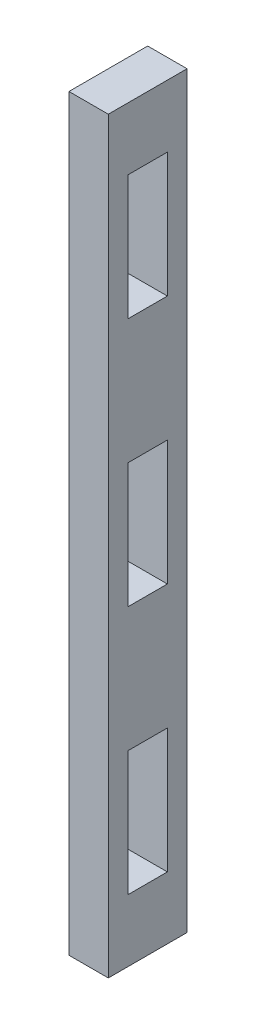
ISO-10303-21;
HEADER;
FILE_DESCRIPTION(('STEP AP214'),'2;1');
FILE_NAME('part.step','',(''),(''),'','','');
FILE_SCHEMA(('AUTOMOTIVE_DESIGN { 1 0 10303 214 1 1 1 1 }'));
ENDSEC;
DATA;
#1=APPLICATION_CONTEXT('core data for automotive mechanical design processes');
#2=APPLICATION_PROTOCOL_DEFINITION('international standard','automotive_design',2000,#1);
#3=PRODUCT_CONTEXT('',#1,'mechanical');
#4=PRODUCT('Part','Part','',(#3));
#5=PRODUCT_RELATED_PRODUCT_CATEGORY('part','',(#4));
#6=PRODUCT_DEFINITION_FORMATION('','',#4);
#7=PRODUCT_DEFINITION_CONTEXT('part definition',#1,'design');
#8=PRODUCT_DEFINITION('design','',#6,#7);
#9=PRODUCT_DEFINITION_SHAPE('','',#8);
#10=(LENGTH_UNIT() NAMED_UNIT(*) SI_UNIT(.MILLI.,.METRE.));
#11=(NAMED_UNIT(*) PLANE_ANGLE_UNIT() SI_UNIT($,.RADIAN.));
#12=(NAMED_UNIT(*) SI_UNIT($,.STERADIAN.) SOLID_ANGLE_UNIT());
#13=UNCERTAINTY_MEASURE_WITH_UNIT(LENGTH_MEASURE(1.E-05),#10,'distance_accuracy_value','');
#14=(GEOMETRIC_REPRESENTATION_CONTEXT(3) GLOBAL_UNCERTAINTY_ASSIGNED_CONTEXT((#13)) GLOBAL_UNIT_ASSIGNED_CONTEXT((#10,
#11,#12)) REPRESENTATION_CONTEXT('',''));
#15=CARTESIAN_POINT('',(0.,0.,0.));
#16=DIRECTION('',(0.,0.,1.));
#17=DIRECTION('',(1.,0.,0.));
#18=AXIS2_PLACEMENT_3D('',#15,#16,#17);
#19=CARTESIAN_POINT('',(0.,55.2979166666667,-1.5875));
#20=DIRECTION('',(0.,1.,0.));
#21=DIRECTION('',(0.,0.,1.));
#22=AXIS2_PLACEMENT_3D('',#19,#20,#21);
#23=PLANE('',#22);
#24=DIRECTION('',(0.,0.,1.));
#25=VECTOR('',#24,1.);
#26=CARTESIAN_POINT('',(3.175,55.2979166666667,-1.5875));
#27=LINE('',#26,#25);
#28=CARTESIAN_POINT('',(3.175,55.2979166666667,-4.7625));
#29=VERTEX_POINT('',#28);
#30=CARTESIAN_POINT('',(3.175,55.2979166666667,-1.5875));
#31=VERTEX_POINT('',#30);
#32=EDGE_CURVE('E263',#29,#31,#27,.T.);
#33=ORIENTED_EDGE('',*,*,#32,.T.);
#34=DIRECTION('',(1.,0.,0.));
#35=VECTOR('',#34,1.);
#36=CARTESIAN_POINT('',(0.,55.2979166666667,-1.5875));
#37=LINE('',#36,#35);
#38=CARTESIAN_POINT('',(0.,55.2979166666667,-1.5875));
#39=VERTEX_POINT('',#38);
#40=EDGE_CURVE('E11',#39,#31,#37,.T.);
#41=ORIENTED_EDGE('',*,*,#40,.F.);
#42=DIRECTION('',(0.,0.,1.));
#43=VECTOR('',#42,1.);
#44=CARTESIAN_POINT('',(0.,55.2979166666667,-1.5875));
#45=LINE('',#44,#43);
#46=CARTESIAN_POINT('',(0.,55.2979166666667,-4.7625));
#47=VERTEX_POINT('',#46);
#48=EDGE_CURVE('E267',#47,#39,#45,.T.);
#49=ORIENTED_EDGE('',*,*,#48,.F.);
#50=DIRECTION('',(1.,0.,0.));
#51=VECTOR('',#50,1.);
#52=CARTESIAN_POINT('',(0.,55.2979166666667,-4.7625));
#53=LINE('',#52,#51);
#54=EDGE_CURVE('E272',#47,#29,#53,.T.);
#55=ORIENTED_EDGE('',*,*,#54,.T.);
#56=EDGE_LOOP('',(#33,#41,#49,#55));
#57=FACE_BOUND('',#56,.T.);
#58=ADVANCED_FACE('F38',(#57),#23,.F.);
#59=CARTESIAN_POINT('',(0.,55.2979166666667,-1.5875));
#60=DIRECTION('',(0.,0.,1.));
#61=DIRECTION('',(0.,-1.,0.));
#62=AXIS2_PLACEMENT_3D('',#59,#60,#61);
#63=PLANE('',#62);
#64=DIRECTION('',(0.,-1.,0.));
#65=VECTOR('',#64,1.);
#66=CARTESIAN_POINT('',(3.175,55.2979166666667,-1.5875));
#67=LINE('',#66,#65);
#68=CARTESIAN_POINT('',(3.175,45.24375,-1.5875));
#69=VERTEX_POINT('',#68);
#70=EDGE_CURVE('E260',#31,#69,#67,.T.);
#71=ORIENTED_EDGE('',*,*,#70,.T.);
#72=DIRECTION('',(1.,0.,0.));
#73=VECTOR('',#72,1.);
#74=CARTESIAN_POINT('',(0.,45.24375,-1.5875));
#75=LINE('',#74,#73);
#76=CARTESIAN_POINT('',(0.,45.24375,-1.5875));
#77=VERTEX_POINT('',#76);
#78=EDGE_CURVE('E45',#77,#69,#75,.T.);
#79=ORIENTED_EDGE('',*,*,#78,.F.);
#80=DIRECTION('',(0.,-1.,0.));
#81=VECTOR('',#80,1.);
#82=CARTESIAN_POINT('',(0.,55.2979166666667,-1.5875));
#83=LINE('',#82,#81);
#84=EDGE_CURVE('E59',#39,#77,#83,.T.);
#85=ORIENTED_EDGE('',*,*,#84,.F.);
#86=ORIENTED_EDGE('',*,*,#40,.T.);
#87=EDGE_LOOP('',(#71,#79,#85,#86));
#88=FACE_BOUND('',#87,.T.);
#89=ADVANCED_FACE('F282',(#88),#63,.F.);
#90=CARTESIAN_POINT('',(0.,45.24375,-1.5875));
#91=DIRECTION('',(0.,-1.,0.));
#92=DIRECTION('',(0.,0.,-1.));
#93=AXIS2_PLACEMENT_3D('',#90,#91,#92);
#94=PLANE('',#93);
#95=DIRECTION('',(0.,0.,-1.));
#96=VECTOR('',#95,1.);
#97=CARTESIAN_POINT('',(3.175,45.24375,-1.5875));
#98=LINE('',#97,#96);
#99=CARTESIAN_POINT('',(3.175,45.24375,-4.7625));
#100=VERTEX_POINT('',#99);
#101=EDGE_CURVE('E257',#69,#100,#98,.T.);
#102=ORIENTED_EDGE('',*,*,#101,.T.);
#103=DIRECTION('',(1.,0.,0.));
#104=VECTOR('',#103,1.);
#105=CARTESIAN_POINT('',(0.,45.24375,-4.7625));
#106=LINE('',#105,#104);
#107=CARTESIAN_POINT('',(0.,45.24375,-4.7625));
#108=VERTEX_POINT('',#107);
#109=EDGE_CURVE('E275',#108,#100,#106,.T.);
#110=ORIENTED_EDGE('',*,*,#109,.F.);
#111=DIRECTION('',(0.,0.,-1.));
#112=VECTOR('',#111,1.);
#113=CARTESIAN_POINT('',(0.,45.24375,-1.5875));
#114=LINE('',#113,#112);
#115=EDGE_CURVE('E270',#77,#108,#114,.T.);
#116=ORIENTED_EDGE('',*,*,#115,.F.);
#117=ORIENTED_EDGE('',*,*,#78,.T.);
#118=EDGE_LOOP('',(#102,#110,#116,#117));
#119=FACE_BOUND('',#118,.T.);
#120=ADVANCED_FACE('F279',(#119),#94,.F.);
#121=CARTESIAN_POINT('',(0.,55.2979166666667,-4.7625));
#122=DIRECTION('',(0.,0.,-1.));
#123=DIRECTION('',(0.,1.,0.));
#124=AXIS2_PLACEMENT_3D('',#121,#122,#123);
#125=PLANE('',#124);
#126=DIRECTION('',(0.,1.,0.));
#127=VECTOR('',#126,1.);
#128=CARTESIAN_POINT('',(3.175,55.2979166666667,-4.7625));
#129=LINE('',#128,#127);
#130=EDGE_CURVE('E255',#100,#29,#129,.T.);
#131=ORIENTED_EDGE('',*,*,#130,.T.);
#132=ORIENTED_EDGE('',*,*,#54,.F.);
#133=DIRECTION('',(0.,1.,0.));
#134=VECTOR('',#133,1.);
#135=CARTESIAN_POINT('',(0.,55.2979166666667,-4.7625));
#136=LINE('',#135,#134);
#137=EDGE_CURVE('E52',#108,#47,#136,.T.);
#138=ORIENTED_EDGE('',*,*,#137,.F.);
#139=ORIENTED_EDGE('',*,*,#109,.T.);
#140=EDGE_LOOP('',(#131,#132,#138,#139));
#141=FACE_BOUND('',#140,.T.);
#142=ADVANCED_FACE('F288',(#141),#125,.F.);
#143=CARTESIAN_POINT('',(3.175,0.,0.));
#144=DIRECTION('',(0.,0.,-1.));
#145=DIRECTION('',(-1.,0.,0.));
#146=AXIS2_PLACEMENT_3D('',#143,#144,#145);
#147=PLANE('',#146);
#148=DIRECTION('',(0.,-1.,0.));
#149=VECTOR('',#148,1.);
#150=CARTESIAN_POINT('',(0.,0.,0.));
#151=LINE('',#150,#149);
#152=CARTESIAN_POINT('',(0.,60.325,0.));
#153=VERTEX_POINT('',#152);
#154=CARTESIAN_POINT('',(0.,0.,0.));
#155=VERTEX_POINT('',#154);
#156=EDGE_CURVE('E219',#153,#155,#151,.T.);
#157=ORIENTED_EDGE('',*,*,#156,.T.);
#158=DIRECTION('',(-1.,0.,0.));
#159=VECTOR('',#158,1.);
#160=CARTESIAN_POINT('',(3.175,0.,0.));
#161=LINE('',#160,#159);
#162=CARTESIAN_POINT('',(3.175,0.,0.));
#163=VERTEX_POINT('',#162);
#164=EDGE_CURVE('E252',#163,#155,#161,.T.);
#165=ORIENTED_EDGE('',*,*,#164,.F.);
#166=DIRECTION('',(0.,-1.,0.));
#167=VECTOR('',#166,1.);
#168=CARTESIAN_POINT('',(3.175,0.,0.));
#169=LINE('',#168,#167);
#170=CARTESIAN_POINT('',(3.175,60.325,0.));
#171=VERTEX_POINT('',#170);
#172=EDGE_CURVE('E226',#171,#163,#169,.T.);
#173=ORIENTED_EDGE('',*,*,#172,.F.);
#174=DIRECTION('',(-1.,0.,0.));
#175=VECTOR('',#174,1.);
#176=CARTESIAN_POINT('',(3.175,60.325,0.));
#177=LINE('',#176,#175);
#178=EDGE_CURVE('E236',#171,#153,#177,.T.);
#179=ORIENTED_EDGE('',*,*,#178,.T.);
#180=EDGE_LOOP('',(#157,#165,#173,#179));
#181=FACE_BOUND('',#180,.T.);
#182=ADVANCED_FACE('F290',(#181),#147,.F.);
#183=CARTESIAN_POINT('',(3.175,0.,0.));
#184=DIRECTION('',(0.,1.,0.));
#185=DIRECTION('',(0.,0.,1.));
#186=AXIS2_PLACEMENT_3D('',#183,#184,#185);
#187=PLANE('',#186);
#188=DIRECTION('',(0.,0.,-1.));
#189=VECTOR('',#188,1.);
#190=CARTESIAN_POINT('',(0.,0.,0.));
#191=LINE('',#190,#189);
#192=CARTESIAN_POINT('',(0.,0.,-6.35));
#193=VERTEX_POINT('',#192);
#194=EDGE_CURVE('E239',#155,#193,#191,.T.);
#195=ORIENTED_EDGE('',*,*,#194,.T.);
#196=DIRECTION('',(-1.,0.,0.));
#197=VECTOR('',#196,1.);
#198=CARTESIAN_POINT('',(3.175,0.,-6.35));
#199=LINE('',#198,#197);
#200=CARTESIAN_POINT('',(3.175,0.,-6.35));
#201=VERTEX_POINT('',#200);
#202=EDGE_CURVE('E249',#201,#193,#199,.T.);
#203=ORIENTED_EDGE('',*,*,#202,.F.);
#204=DIRECTION('',(0.,0.,-1.));
#205=VECTOR('',#204,1.);
#206=CARTESIAN_POINT('',(3.175,0.,0.));
#207=LINE('',#206,#205);
#208=EDGE_CURVE('E229',#163,#201,#207,.T.);
#209=ORIENTED_EDGE('',*,*,#208,.F.);
#210=ORIENTED_EDGE('',*,*,#164,.T.);
#211=EDGE_LOOP('',(#195,#203,#209,#210));
#212=FACE_BOUND('',#211,.T.);
#213=ADVANCED_FACE('F296',(#212),#187,.F.);
#214=CARTESIAN_POINT('',(3.175,0.,-6.35));
#215=DIRECTION('',(0.,0.,1.));
#216=DIRECTION('',(1.,0.,0.));
#217=AXIS2_PLACEMENT_3D('',#214,#215,#216);
#218=PLANE('',#217);
#219=DIRECTION('',(0.,1.,0.));
#220=VECTOR('',#219,1.);
#221=CARTESIAN_POINT('',(0.,0.,-6.35));
#222=LINE('',#221,#220);
#223=CARTESIAN_POINT('',(0.,60.325,-6.35));
#224=VERTEX_POINT('',#223);
#225=EDGE_CURVE('E241',#193,#224,#222,.T.);
#226=ORIENTED_EDGE('',*,*,#225,.T.);
#227=DIRECTION('',(-1.,0.,0.));
#228=VECTOR('',#227,1.);
#229=CARTESIAN_POINT('',(3.175,60.325,-6.35));
#230=LINE('',#229,#228);
#231=CARTESIAN_POINT('',(3.175,60.325,-6.35));
#232=VERTEX_POINT('',#231);
#233=EDGE_CURVE('E246',#232,#224,#230,.T.);
#234=ORIENTED_EDGE('',*,*,#233,.F.);
#235=DIRECTION('',(0.,1.,0.));
#236=VECTOR('',#235,1.);
#237=CARTESIAN_POINT('',(3.175,0.,-6.35));
#238=LINE('',#237,#236);
#239=EDGE_CURVE('E232',#201,#232,#238,.T.);
#240=ORIENTED_EDGE('',*,*,#239,.F.);
#241=ORIENTED_EDGE('',*,*,#202,.T.);
#242=EDGE_LOOP('',(#226,#234,#240,#241));
#243=FACE_BOUND('',#242,.T.);
#244=ADVANCED_FACE('F394',(#243),#218,.F.);
#245=CARTESIAN_POINT('',(3.175,60.325,0.));
#246=DIRECTION('',(0.,-1.,0.));
#247=DIRECTION('',(0.,0.,-1.));
#248=AXIS2_PLACEMENT_3D('',#245,#246,#247);
#249=PLANE('',#248);
#250=DIRECTION('',(0.,0.,1.));
#251=VECTOR('',#250,1.);
#252=CARTESIAN_POINT('',(0.,60.325,0.));
#253=LINE('',#252,#251);
#254=EDGE_CURVE('E230',#224,#153,#253,.T.);
#255=ORIENTED_EDGE('',*,*,#254,.T.);
#256=ORIENTED_EDGE('',*,*,#178,.F.);
#257=DIRECTION('',(0.,0.,1.));
#258=VECTOR('',#257,1.);
#259=CARTESIAN_POINT('',(3.175,60.325,0.));
#260=LINE('',#259,#258);
#261=EDGE_CURVE('E234',#232,#171,#260,.T.);
#262=ORIENTED_EDGE('',*,*,#261,.F.);
#263=ORIENTED_EDGE('',*,*,#233,.T.);
#264=EDGE_LOOP('',(#255,#256,#262,#263));
#265=FACE_BOUND('',#264,.T.);
#266=ADVANCED_FACE('F325',(#265),#249,.F.);
#267=CARTESIAN_POINT('',(3.175,0.,0.));
#268=DIRECTION('',(-1.,0.,0.));
#269=DIRECTION('',(0.,0.,1.));
#270=AXIS2_PLACEMENT_3D('',#267,#268,#269);
#271=PLANE('',#270);
#272=DIRECTION('',(0.,0.,1.));
#273=VECTOR('',#272,1.);
#274=CARTESIAN_POINT('',(3.175,35.1895833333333,-1.5875));
#275=LINE('',#274,#273);
#276=CARTESIAN_POINT('',(3.175,35.1895833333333,-4.7625));
#277=VERTEX_POINT('',#276);
#278=CARTESIAN_POINT('',(3.175,35.1895833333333,-1.5875));
#279=VERTEX_POINT('',#278);
#280=EDGE_CURVE('E152',#277,#279,#275,.T.);
#281=ORIENTED_EDGE('',*,*,#280,.F.);
#282=DIRECTION('',(0.,1.,0.));
#283=VECTOR('',#282,1.);
#284=CARTESIAN_POINT('',(3.175,35.1895833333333,-4.7625));
#285=LINE('',#284,#283);
#286=CARTESIAN_POINT('',(3.175,25.1354166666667,-4.7625));
#287=VERTEX_POINT('',#286);
#288=EDGE_CURVE('E188',#287,#277,#285,.T.);
#289=ORIENTED_EDGE('',*,*,#288,.F.);
#290=DIRECTION('',(0.,0.,-1.));
#291=VECTOR('',#290,1.);
#292=CARTESIAN_POINT('',(3.175,25.1354166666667,-1.5875));
#293=LINE('',#292,#291);
#294=CARTESIAN_POINT('',(3.175,25.1354166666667,-1.5875));
#295=VERTEX_POINT('',#294);
#296=EDGE_CURVE('E174',#295,#287,#293,.T.);
#297=ORIENTED_EDGE('',*,*,#296,.F.);
#298=DIRECTION('',(0.,-1.,0.));
#299=VECTOR('',#298,1.);
#300=CARTESIAN_POINT('',(3.175,35.1895833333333,-1.5875));
#301=LINE('',#300,#299);
#302=EDGE_CURVE('E166',#279,#295,#301,.T.);
#303=ORIENTED_EDGE('',*,*,#302,.F.);
#304=EDGE_LOOP('',(#281,#289,#297,#303));
#305=FACE_BOUND('',#304,.T.);
#306=DIRECTION('',(0.,0.,1.));
#307=VECTOR('',#306,1.);
#308=CARTESIAN_POINT('',(3.175,15.08125,-1.5875));
#309=LINE('',#308,#307);
#310=CARTESIAN_POINT('',(3.175,15.08125,-4.7625));
#311=VERTEX_POINT('',#310);
#312=CARTESIAN_POINT('',(3.175,15.08125,-1.5875));
#313=VERTEX_POINT('',#312);
#314=EDGE_CURVE('E209',#311,#313,#309,.T.);
#315=ORIENTED_EDGE('',*,*,#314,.F.);
#316=DIRECTION('',(0.,1.,0.));
#317=VECTOR('',#316,1.);
#318=CARTESIAN_POINT('',(3.175,15.08125,-4.7625));
#319=LINE('',#318,#317);
#320=CARTESIAN_POINT('',(3.175,5.02708333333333,-4.7625));
#321=VERTEX_POINT('',#320);
#322=EDGE_CURVE('E193',#321,#311,#319,.T.);
#323=ORIENTED_EDGE('',*,*,#322,.F.);
#324=DIRECTION('',(0.,0.,-1.));
#325=VECTOR('',#324,1.);
#326=CARTESIAN_POINT('',(3.175,5.02708333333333,-1.5875));
#327=LINE('',#326,#325);
#328=CARTESIAN_POINT('',(3.175,5.02708333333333,-1.5875));
#329=VERTEX_POINT('',#328);
#330=EDGE_CURVE('E198',#329,#321,#327,.T.);
#331=ORIENTED_EDGE('',*,*,#330,.F.);
#332=DIRECTION('',(0.,-1.,0.));
#333=VECTOR('',#332,1.);
#334=CARTESIAN_POINT('',(3.175,15.08125,-1.5875));
#335=LINE('',#334,#333);
#336=EDGE_CURVE('E212',#313,#329,#335,.T.);
#337=ORIENTED_EDGE('',*,*,#336,.F.);
#338=EDGE_LOOP('',(#315,#323,#331,#337));
#339=FACE_BOUND('',#338,.T.);
#340=ORIENTED_EDGE('',*,*,#172,.T.);
#341=ORIENTED_EDGE('',*,*,#208,.T.);
#342=ORIENTED_EDGE('',*,*,#239,.T.);
#343=ORIENTED_EDGE('',*,*,#261,.T.);
#344=EDGE_LOOP('',(#340,#341,#342,#343));
#345=FACE_BOUND('',#344,.T.);
#346=ORIENTED_EDGE('',*,*,#130,.F.);
#347=ORIENTED_EDGE('',*,*,#101,.F.);
#348=ORIENTED_EDGE('',*,*,#70,.F.);
#349=ORIENTED_EDGE('',*,*,#32,.F.);
#350=EDGE_LOOP('',(#346,#347,#348,#349));
#351=FACE_BOUND('',#350,.T.);
#352=ADVANCED_FACE('F172',(#305,#339,#345,#351),#271,.F.);
#353=CARTESIAN_POINT('',(0.,0.,0.));
#354=DIRECTION('',(-1.,0.,0.));
#355=DIRECTION('',(0.,0.,1.));
#356=AXIS2_PLACEMENT_3D('',#353,#354,#355);
#357=PLANE('',#356);
#358=DIRECTION('',(0.,1.,0.));
#359=VECTOR('',#358,1.);
#360=CARTESIAN_POINT('',(0.,35.1895833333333,-4.7625));
#361=LINE('',#360,#359);
#362=CARTESIAN_POINT('',(0.,25.1354166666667,-4.7625));
#363=VERTEX_POINT('',#362);
#364=CARTESIAN_POINT('',(0.,35.1895833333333,-4.7625));
#365=VERTEX_POINT('',#364);
#366=EDGE_CURVE('E190',#363,#365,#361,.T.);
#367=ORIENTED_EDGE('',*,*,#366,.T.);
#368=DIRECTION('',(0.,0.,1.));
#369=VECTOR('',#368,1.);
#370=CARTESIAN_POINT('',(0.,35.1895833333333,-1.5875));
#371=LINE('',#370,#369);
#372=CARTESIAN_POINT('',(0.,35.1895833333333,-1.5875));
#373=VERTEX_POINT('',#372);
#374=EDGE_CURVE('E162',#365,#373,#371,.T.);
#375=ORIENTED_EDGE('',*,*,#374,.T.);
#376=DIRECTION('',(0.,-1.,0.));
#377=VECTOR('',#376,1.);
#378=CARTESIAN_POINT('',(0.,35.1895833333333,-1.5875));
#379=LINE('',#378,#377);
#380=CARTESIAN_POINT('',(0.,25.1354166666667,-1.5875));
#381=VERTEX_POINT('',#380);
#382=EDGE_CURVE('E169',#373,#381,#379,.T.);
#383=ORIENTED_EDGE('',*,*,#382,.T.);
#384=DIRECTION('',(0.,0.,-1.));
#385=VECTOR('',#384,1.);
#386=CARTESIAN_POINT('',(0.,25.1354166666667,-1.5875));
#387=LINE('',#386,#385);
#388=EDGE_CURVE('E185',#381,#363,#387,.T.);
#389=ORIENTED_EDGE('',*,*,#388,.T.);
#390=EDGE_LOOP('',(#367,#375,#383,#389));
#391=FACE_BOUND('',#390,.T.);
#392=DIRECTION('',(0.,1.,0.));
#393=VECTOR('',#392,1.);
#394=CARTESIAN_POINT('',(0.,15.08125,-4.7625));
#395=LINE('',#394,#393);
#396=CARTESIAN_POINT('',(0.,5.02708333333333,-4.7625));
#397=VERTEX_POINT('',#396);
#398=CARTESIAN_POINT('',(0.,15.08125,-4.7625));
#399=VERTEX_POINT('',#398);
#400=EDGE_CURVE('E194',#397,#399,#395,.T.);
#401=ORIENTED_EDGE('',*,*,#400,.T.);
#402=DIRECTION('',(0.,0.,1.));
#403=VECTOR('',#402,1.);
#404=CARTESIAN_POINT('',(0.,15.08125,-1.5875));
#405=LINE('',#404,#403);
#406=CARTESIAN_POINT('',(0.,15.08125,-1.5875));
#407=VERTEX_POINT('',#406);
#408=EDGE_CURVE('E197',#399,#407,#405,.T.);
#409=ORIENTED_EDGE('',*,*,#408,.T.);
#410=DIRECTION('',(0.,-1.,0.));
#411=VECTOR('',#410,1.);
#412=CARTESIAN_POINT('',(0.,15.08125,-1.5875));
#413=LINE('',#412,#411);
#414=CARTESIAN_POINT('',(0.,5.02708333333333,-1.5875));
#415=VERTEX_POINT('',#414);
#416=EDGE_CURVE('E201',#407,#415,#413,.T.);
#417=ORIENTED_EDGE('',*,*,#416,.T.);
#418=DIRECTION('',(0.,0.,-1.));
#419=VECTOR('',#418,1.);
#420=CARTESIAN_POINT('',(0.,5.02708333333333,-1.5875));
#421=LINE('',#420,#419);
#422=EDGE_CURVE('E204',#415,#397,#421,.T.);
#423=ORIENTED_EDGE('',*,*,#422,.T.);
#424=EDGE_LOOP('',(#401,#409,#417,#423));
#425=FACE_BOUND('',#424,.T.);
#426=ORIENTED_EDGE('',*,*,#156,.F.);
#427=ORIENTED_EDGE('',*,*,#254,.F.);
#428=ORIENTED_EDGE('',*,*,#225,.F.);
#429=ORIENTED_EDGE('',*,*,#194,.F.);
#430=EDGE_LOOP('',(#426,#427,#428,#429));
#431=FACE_BOUND('',#430,.T.);
#432=ORIENTED_EDGE('',*,*,#137,.T.);
#433=ORIENTED_EDGE('',*,*,#48,.T.);
#434=ORIENTED_EDGE('',*,*,#84,.T.);
#435=ORIENTED_EDGE('',*,*,#115,.T.);
#436=EDGE_LOOP('',(#432,#433,#434,#435));
#437=FACE_BOUND('',#436,.T.);
#438=ADVANCED_FACE('F324',(#391,#425,#431,#437),#357,.T.);
#439=CARTESIAN_POINT('',(0.,15.08125,-4.7625));
#440=DIRECTION('',(0.,0.,-1.));
#441=DIRECTION('',(0.,1.,0.));
#442=AXIS2_PLACEMENT_3D('',#439,#440,#441);
#443=PLANE('',#442);
#444=ORIENTED_EDGE('',*,*,#322,.T.);
#445=DIRECTION('',(1.,0.,0.));
#446=VECTOR('',#445,1.);
#447=CARTESIAN_POINT('',(0.,15.08125,-4.7625));
#448=LINE('',#447,#446);
#449=EDGE_CURVE('E207',#399,#311,#448,.T.);
#450=ORIENTED_EDGE('',*,*,#449,.F.);
#451=ORIENTED_EDGE('',*,*,#400,.F.);
#452=DIRECTION('',(1.,0.,0.));
#453=VECTOR('',#452,1.);
#454=CARTESIAN_POINT('',(0.,5.02708333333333,-4.7625));
#455=LINE('',#454,#453);
#456=EDGE_CURVE('E217',#397,#321,#455,.T.);
#457=ORIENTED_EDGE('',*,*,#456,.T.);
#458=EDGE_LOOP('',(#444,#450,#451,#457));
#459=FACE_BOUND('',#458,.T.);
#460=ADVANCED_FACE('F336',(#459),#443,.F.);
#461=CARTESIAN_POINT('',(0.,5.02708333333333,-1.5875));
#462=DIRECTION('',(0.,-1.,0.));
#463=DIRECTION('',(0.,0.,-1.));
#464=AXIS2_PLACEMENT_3D('',#461,#462,#463);
#465=PLANE('',#464);
#466=ORIENTED_EDGE('',*,*,#330,.T.);
#467=ORIENTED_EDGE('',*,*,#456,.F.);
#468=ORIENTED_EDGE('',*,*,#422,.F.);
#469=DIRECTION('',(1.,0.,0.));
#470=VECTOR('',#469,1.);
#471=CARTESIAN_POINT('',(0.,5.02708333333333,-1.5875));
#472=LINE('',#471,#470);
#473=EDGE_CURVE('E220',#415,#329,#472,.T.);
#474=ORIENTED_EDGE('',*,*,#473,.T.);
#475=EDGE_LOOP('',(#466,#467,#468,#474));
#476=FACE_BOUND('',#475,.T.);
#477=ADVANCED_FACE('F381',(#476),#465,.F.);
#478=CARTESIAN_POINT('',(0.,15.08125,-1.5875));
#479=DIRECTION('',(0.,0.,1.));
#480=DIRECTION('',(0.,-1.,0.));
#481=AXIS2_PLACEMENT_3D('',#478,#479,#480);
#482=PLANE('',#481);
#483=ORIENTED_EDGE('',*,*,#336,.T.);
#484=ORIENTED_EDGE('',*,*,#473,.F.);
#485=ORIENTED_EDGE('',*,*,#416,.F.);
#486=DIRECTION('',(1.,0.,0.));
#487=VECTOR('',#486,1.);
#488=CARTESIAN_POINT('',(0.,15.08125,-1.5875));
#489=LINE('',#488,#487);
#490=EDGE_CURVE('E222',#407,#313,#489,.T.);
#491=ORIENTED_EDGE('',*,*,#490,.T.);
#492=EDGE_LOOP('',(#483,#484,#485,#491));
#493=FACE_BOUND('',#492,.T.);
#494=ADVANCED_FACE('F384',(#493),#482,.F.);
#495=CARTESIAN_POINT('',(0.,15.08125,-1.5875));
#496=DIRECTION('',(0.,1.,0.));
#497=DIRECTION('',(0.,0.,1.));
#498=AXIS2_PLACEMENT_3D('',#495,#496,#497);
#499=PLANE('',#498);
#500=ORIENTED_EDGE('',*,*,#314,.T.);
#501=ORIENTED_EDGE('',*,*,#490,.F.);
#502=ORIENTED_EDGE('',*,*,#408,.F.);
#503=ORIENTED_EDGE('',*,*,#449,.T.);
#504=EDGE_LOOP('',(#500,#501,#502,#503));
#505=FACE_BOUND('',#504,.T.);
#506=ADVANCED_FACE('F349',(#505),#499,.F.);
#507=CARTESIAN_POINT('',(0.,35.1895833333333,-4.7625));
#508=DIRECTION('',(0.,0.,-1.));
#509=DIRECTION('',(0.,1.,0.));
#510=AXIS2_PLACEMENT_3D('',#507,#508,#509);
#511=PLANE('',#510);
#512=ORIENTED_EDGE('',*,*,#288,.T.);
#513=DIRECTION('',(1.,0.,0.));
#514=VECTOR('',#513,1.);
#515=CARTESIAN_POINT('',(0.,35.1895833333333,-4.7625));
#516=LINE('',#515,#514);
#517=EDGE_CURVE('E158',#365,#277,#516,.T.);
#518=ORIENTED_EDGE('',*,*,#517,.F.);
#519=ORIENTED_EDGE('',*,*,#366,.F.);
#520=DIRECTION('',(1.,0.,0.));
#521=VECTOR('',#520,1.);
#522=CARTESIAN_POINT('',(0.,25.1354166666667,-4.7625));
#523=LINE('',#522,#521);
#524=EDGE_CURVE('E182',#363,#287,#523,.T.);
#525=ORIENTED_EDGE('',*,*,#524,.T.);
#526=EDGE_LOOP('',(#512,#518,#519,#525));
#527=FACE_BOUND('',#526,.T.);
#528=ADVANCED_FACE('F344',(#527),#511,.F.);
#529=CARTESIAN_POINT('',(0.,25.1354166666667,-1.5875));
#530=DIRECTION('',(0.,-1.,0.));
#531=DIRECTION('',(0.,0.,-1.));
#532=AXIS2_PLACEMENT_3D('',#529,#530,#531);
#533=PLANE('',#532);
#534=ORIENTED_EDGE('',*,*,#296,.T.);
#535=ORIENTED_EDGE('',*,*,#524,.F.);
#536=ORIENTED_EDGE('',*,*,#388,.F.);
#537=DIRECTION('',(1.,0.,0.));
#538=VECTOR('',#537,1.);
#539=CARTESIAN_POINT('',(0.,25.1354166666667,-1.5875));
#540=LINE('',#539,#538);
#541=EDGE_CURVE('E175',#381,#295,#540,.T.);
#542=ORIENTED_EDGE('',*,*,#541,.T.);
#543=EDGE_LOOP('',(#534,#535,#536,#542));
#544=FACE_BOUND('',#543,.T.);
#545=ADVANCED_FACE('F348',(#544),#533,.F.);
#546=CARTESIAN_POINT('',(0.,35.1895833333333,-1.5875));
#547=DIRECTION('',(0.,0.,1.));
#548=DIRECTION('',(0.,-1.,0.));
#549=AXIS2_PLACEMENT_3D('',#546,#547,#548);
#550=PLANE('',#549);
#551=ORIENTED_EDGE('',*,*,#302,.T.);
#552=ORIENTED_EDGE('',*,*,#541,.F.);
#553=ORIENTED_EDGE('',*,*,#382,.F.);
#554=DIRECTION('',(1.,0.,0.));
#555=VECTOR('',#554,1.);
#556=CARTESIAN_POINT('',(0.,35.1895833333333,-1.5875));
#557=LINE('',#556,#555);
#558=EDGE_CURVE('E155',#373,#279,#557,.T.);
#559=ORIENTED_EDGE('',*,*,#558,.T.);
#560=EDGE_LOOP('',(#551,#552,#553,#559));
#561=FACE_BOUND('',#560,.T.);
#562=ADVANCED_FACE('F165',(#561),#550,.F.);
#563=CARTESIAN_POINT('',(0.,35.1895833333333,-1.5875));
#564=DIRECTION('',(0.,1.,0.));
#565=DIRECTION('',(0.,0.,1.));
#566=AXIS2_PLACEMENT_3D('',#563,#564,#565);
#567=PLANE('',#566);
#568=ORIENTED_EDGE('',*,*,#280,.T.);
#569=ORIENTED_EDGE('',*,*,#558,.F.);
#570=ORIENTED_EDGE('',*,*,#374,.F.);
#571=ORIENTED_EDGE('',*,*,#517,.T.);
#572=EDGE_LOOP('',(#568,#569,#570,#571));
#573=FACE_BOUND('',#572,.T.);
#574=ADVANCED_FACE('F154',(#573),#567,.F.);
#575=CLOSED_SHELL('',(#58,#89,#120,#142,#182,#213,#244,#266,#352,#438,#460,#477,#494,#506,#528,
#545,#562,#574));
#576=MANIFOLD_SOLID_BREP('B2',#575);
#577=ADVANCED_BREP_SHAPE_REPRESENTATION('',(#18,#576),#14);
#578=SHAPE_DEFINITION_REPRESENTATION(#9,#577);
ENDSEC;
END-ISO-10303-21;
